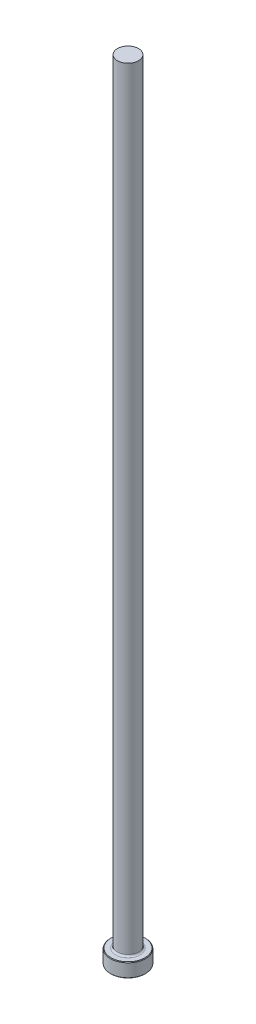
from build123d import *

# Parameters (mm, degrees)
CHAMFER1_SIZE = 0.254
FILLET1_R     = 0.762


with BuildPart() as part:
    # Sketch1 → Revolve1 (revolve)
    with BuildSketch(Plane.XY, mode=Mode.PRIVATE) as revolve1_sk:
        Polygon((0, 0), (-7.9375, 0), (-7.9375, 6.35), (-4.7625, 6.35), (-4.7625, 355.6), (0, 355.6), align=None)
    revolve(revolve1_sk.sketch.rotate(Axis((0, 259.958771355, 0), (0, -1, 0)), 270), axis=Axis((0, 259.958771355, 0), (0, -1, 0)))

    # Chamfer1
    chamfer1_edges = [part.edges().sort_by_distance(p)[0] for p in [
        (0, 6.35, -7.9375),
        (0, 0, -7.9375),
    ]]
    chamfer(chamfer1_edges, length=CHAMFER1_SIZE)

    # Fillet1
    fillet1_edges = [part.edges().sort_by_distance(p)[0] for p in [
        (0, 6.35, -4.7625),
    ]]
    fillet(fillet1_edges, radius=FILLET1_R)


solid = part.part
